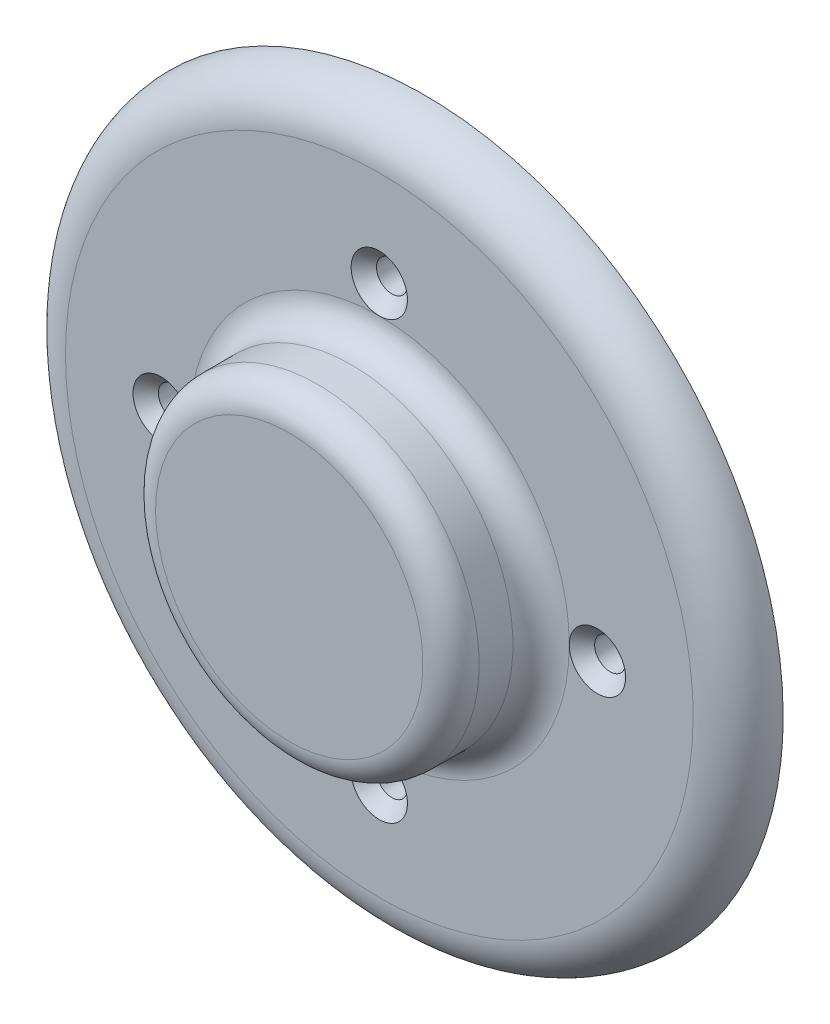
ISO-10303-21;
HEADER;
FILE_DESCRIPTION(('STEP AP214'),'2;1');
FILE_NAME('part.step','',(''),(''),'','','');
FILE_SCHEMA(('AUTOMOTIVE_DESIGN { 1 0 10303 214 1 1 1 1 }'));
ENDSEC;
DATA;
#1=APPLICATION_CONTEXT('core data for automotive mechanical design processes');
#2=APPLICATION_PROTOCOL_DEFINITION('international standard','automotive_design',2000,#1);
#3=PRODUCT_CONTEXT('',#1,'mechanical');
#4=PRODUCT('Part','Part','',(#3));
#5=PRODUCT_RELATED_PRODUCT_CATEGORY('part','',(#4));
#6=PRODUCT_DEFINITION_FORMATION('','',#4);
#7=PRODUCT_DEFINITION_CONTEXT('part definition',#1,'design');
#8=PRODUCT_DEFINITION('design','',#6,#7);
#9=PRODUCT_DEFINITION_SHAPE('','',#8);
#10=(LENGTH_UNIT() NAMED_UNIT(*) SI_UNIT(.MILLI.,.METRE.));
#11=(NAMED_UNIT(*) PLANE_ANGLE_UNIT() SI_UNIT($,.RADIAN.));
#12=(NAMED_UNIT(*) SI_UNIT($,.STERADIAN.) SOLID_ANGLE_UNIT());
#13=UNCERTAINTY_MEASURE_WITH_UNIT(LENGTH_MEASURE(1.E-05),#10,'distance_accuracy_value','');
#14=(GEOMETRIC_REPRESENTATION_CONTEXT(3) GLOBAL_UNCERTAINTY_ASSIGNED_CONTEXT((#13)) GLOBAL_UNIT_ASSIGNED_CONTEXT((#10,
#11,#12)) REPRESENTATION_CONTEXT('',''));
#15=CARTESIAN_POINT('',(0.,0.,0.));
#16=DIRECTION('',(0.,0.,1.));
#17=DIRECTION('',(1.,0.,0.));
#18=AXIS2_PLACEMENT_3D('',#15,#16,#17);
#19=CARTESIAN_POINT('',(111.5,0.,-32.));
#20=CARTESIAN_POINT('',(111.5,7.29765793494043,-32.));
#21=CARTESIAN_POINT('',(110.781261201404,14.5951354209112,-32.));
#22=CARTESIAN_POINT('',(107.933856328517,28.9100063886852,-32.));
#23=CARTESIAN_POINT('',(105.805260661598,35.9270459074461,-32.));
#24=CARTESIAN_POINT('',(100.219875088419,49.4113595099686,-32.));
#25=CARTESIAN_POINT('',(96.763223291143,55.8783001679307,-32.));
#26=CARTESIAN_POINT('',(88.6545002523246,68.0138617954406,-32.));
#27=CARTESIAN_POINT('',(84.0026295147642,73.6821826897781,-32.));
#28=CARTESIAN_POINT('',(73.6821826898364,84.0026295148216,-32.));
#29=CARTESIAN_POINT('',(68.0138617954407,88.6545002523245,-32.));
#30=CARTESIAN_POINT('',(55.8783001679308,96.763223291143,-32.));
#31=CARTESIAN_POINT('',(49.4113595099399,100.219875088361,-32.));
#32=CARTESIAN_POINT('',(35.9270459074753,105.805260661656,-32.));
#33=CARTESIAN_POINT('',(28.9100063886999,107.933856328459,-32.));
#34=CARTESIAN_POINT('',(14.595135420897,110.781261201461,-32.));
#35=CARTESIAN_POINT('',(7.29765793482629,111.5,-32.));
#36=CARTESIAN_POINT('',(-7.29765793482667,111.5,-32.));
#37=CARTESIAN_POINT('',(-14.5951354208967,110.781261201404,-32.));
#38=CARTESIAN_POINT('',(-28.9100063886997,107.933856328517,-32.));
#39=CARTESIAN_POINT('',(-35.9270459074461,105.805260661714,-32.));
#40=CARTESIAN_POINT('',(-49.4113595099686,100.219875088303,-32.));
#41=CARTESIAN_POINT('',(-55.8783001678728,96.763223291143,-32.));
#42=CARTESIAN_POINT('',(-68.0138617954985,88.6545002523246,-32.));
#43=CARTESIAN_POINT('',(-73.6821826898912,84.0026295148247,-32.));
#44=CARTESIAN_POINT('',(-84.0026295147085,73.6821826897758,-32.));
#45=CARTESIAN_POINT('',(-88.6545002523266,68.0138617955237,-32.));
#46=CARTESIAN_POINT('',(-96.7632232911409,55.8783001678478,-32.));
#47=CARTESIAN_POINT('',(-100.219875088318,49.4113595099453,-32.));
#48=CARTESIAN_POINT('',(-105.805260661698,35.92704590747,-32.));
#49=CARTESIAN_POINT('',(-107.933856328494,28.9100063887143,-32.));
#50=CARTESIAN_POINT('',(-110.781261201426,14.5951354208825,-32.));
#51=CARTESIAN_POINT('',(-111.5,7.29765793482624,-32.));
#52=CARTESIAN_POINT('',(-111.5,-7.29765793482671,-32.));
#53=CARTESIAN_POINT('',(-110.781261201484,-14.5951354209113,-32.));
#54=CARTESIAN_POINT('',(-107.933856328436,-28.9100063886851,-32.));
#55=CARTESIAN_POINT('',(-105.805260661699,-35.9270459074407,-32.));
#56=CARTESIAN_POINT('',(-100.219875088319,-49.411359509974,-32.));
#57=CARTESIAN_POINT('',(-96.763223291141,-55.8783001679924,-32.));
#58=CARTESIAN_POINT('',(-88.6545002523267,-68.0138617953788,-32.));
#59=CARTESIAN_POINT('',(-84.0026295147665,-73.6821826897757,-32.));
#60=CARTESIAN_POINT('',(-73.6821826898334,-84.0026295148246,-32.));
#61=CARTESIAN_POINT('',(-68.0138617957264,-88.6545002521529,-32.));
#62=CARTESIAN_POINT('',(-55.8783001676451,-96.7632232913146,-32.));
#63=CARTESIAN_POINT('',(-49.4113595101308,-100.219875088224,-32.));
#64=CARTESIAN_POINT('',(-35.9270459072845,-105.805260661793,-32.));
#65=CARTESIAN_POINT('',(-28.9100063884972,-107.933856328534,-32.));
#66=CARTESIAN_POINT('',(-14.5951354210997,-110.781261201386,-32.));
#67=CARTESIAN_POINT('',(-7.297657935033,-111.5,-32.));
#68=CARTESIAN_POINT('',(7.29765793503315,-111.5,-32.));
#69=CARTESIAN_POINT('',(14.5951354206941,-110.781261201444,-32.));
#70=CARTESIAN_POINT('',(28.9100063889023,-107.933856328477,-32.));
#71=CARTESIAN_POINT('',(35.9270459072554,-105.805260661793,-32.));
#72=CARTESIAN_POINT('',(49.4113595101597,-100.219875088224,-32.));
#73=CARTESIAN_POINT('',(55.8783001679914,-96.7632232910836,-32.));
#74=CARTESIAN_POINT('',(68.0138617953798,-88.654500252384,-32.));
#75=CARTESIAN_POINT('',(73.6821826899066,-84.0026295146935,-32.));
#76=CARTESIAN_POINT('',(84.0026295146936,-73.6821826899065,-32.));
#77=CARTESIAN_POINT('',(88.6545002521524,-68.0138617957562,-32.));
#78=CARTESIAN_POINT('',(96.7632232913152,-55.8783001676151,-32.));
#79=CARTESIAN_POINT('',(100.219875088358,-49.4113595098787,-32.));
#80=CARTESIAN_POINT('',(105.805260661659,-35.9270459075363,-32.));
#81=CARTESIAN_POINT('',(107.933856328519,-28.9100063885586,-32.));
#82=CARTESIAN_POINT('',(110.781261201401,-14.5951354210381,-32.));
#83=CARTESIAN_POINT('',(111.5,-7.29765793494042,-32.));
#84=CARTESIAN_POINT('',(111.5,0.,-32.));
#85=CARTESIAN_POINT('',(127.5,0.,-32.));
#86=CARTESIAN_POINT('',(127.5,8.34485548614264,-32.));
#87=CARTESIAN_POINT('',(126.678123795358,16.6895046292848,-32.));
#88=CARTESIAN_POINT('',(123.422122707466,33.0585274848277,-32.));
#89=CARTESIAN_POINT('',(120.988078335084,41.0824964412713,-32.));
#90=CARTESIAN_POINT('',(114.601202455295,56.5017788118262,-32.));
#91=CARTESIAN_POINT('',(110.648528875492,63.8967109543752,-32.));
#92=CARTESIAN_POINT('',(101.376222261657,77.7736984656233,-32.));
#93=CARTESIAN_POINT('',(96.0568185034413,84.2554106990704,-32.));
#94=CARTESIAN_POINT('',(84.2554106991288,96.0568185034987,-32.));
#95=CARTESIAN_POINT('',(77.7736984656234,101.376222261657,-32.));
#96=CARTESIAN_POINT('',(63.8967109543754,110.648528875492,-32.));
#97=CARTESIAN_POINT('',(56.5017788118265,114.601202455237,-32.));
#98=CARTESIAN_POINT('',(41.0824964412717,120.988078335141,-32.));
#99=CARTESIAN_POINT('',(33.058527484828,123.422122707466,-32.));
#100=CARTESIAN_POINT('',(16.689504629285,126.678123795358,-32.));
#101=CARTESIAN_POINT('',(8.34485548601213,127.5,-32.));
#102=CARTESIAN_POINT('',(-8.34485548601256,127.5,-32.));
#103=CARTESIAN_POINT('',(-16.6895046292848,126.678123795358,-32.));
#104=CARTESIAN_POINT('',(-33.0585274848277,123.422122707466,-32.));
#105=CARTESIAN_POINT('',(-41.0824964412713,120.988078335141,-32.));
#106=CARTESIAN_POINT('',(-56.5017788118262,114.601202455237,-32.));
#107=CARTESIAN_POINT('',(-63.8967109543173,110.648528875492,-32.));
#108=CARTESIAN_POINT('',(-77.7736984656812,101.376222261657,-32.));
#109=CARTESIAN_POINT('',(-84.2554106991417,96.0568185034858,-32.));
#110=CARTESIAN_POINT('',(-96.0568185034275,84.2554106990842,-32.));
#111=CARTESIAN_POINT('',(-101.376222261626,77.7736984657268,-32.));
#112=CARTESIAN_POINT('',(-110.648528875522,63.896710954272,-32.));
#113=CARTESIAN_POINT('',(-114.601202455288,56.5017788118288,-32.));
#114=CARTESIAN_POINT('',(-120.98807833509,41.0824964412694,-32.));
#115=CARTESIAN_POINT('',(-123.422122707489,33.0585274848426,-32.));
#116=CARTESIAN_POINT('',(-126.678123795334,16.6895046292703,-32.));
#117=CARTESIAN_POINT('',(-127.5,8.34485548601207,-32.));
#118=CARTESIAN_POINT('',(-127.5,-8.34485548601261,-32.));
#119=CARTESIAN_POINT('',(-126.678123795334,-16.6895046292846,-32.));
#120=CARTESIAN_POINT('',(-123.422122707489,-33.0585274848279,-32.));
#121=CARTESIAN_POINT('',(-120.988078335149,-41.0824964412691,-32.));
#122=CARTESIAN_POINT('',(-114.60120245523,-56.5017788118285,-32.));
#123=CARTESIAN_POINT('',(-110.648528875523,-63.8967109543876,-32.));
#124=CARTESIAN_POINT('',(-101.376222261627,-77.7736984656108,-32.));
#125=CARTESIAN_POINT('',(-96.0568185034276,-84.2554106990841,-32.));
#126=CARTESIAN_POINT('',(-84.2554106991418,-96.0568185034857,-32.));
#127=CARTESIAN_POINT('',(-77.7736984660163,-101.376222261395,-32.));
#128=CARTESIAN_POINT('',(-63.8967109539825,-110.648528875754,-32.));
#129=CARTESIAN_POINT('',(-56.5017788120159,-114.601202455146,-32.));
#130=CARTESIAN_POINT('',(-41.0824964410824,-120.988078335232,-32.));
#131=CARTESIAN_POINT('',(-33.0585274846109,-123.422122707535,-32.));
#132=CARTESIAN_POINT('',(-16.6895046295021,-126.678123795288,-32.));
#133=CARTESIAN_POINT('',(-8.34485548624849,-127.5,-32.));
#134=CARTESIAN_POINT('',(8.34485548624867,-127.5,-32.));
#135=CARTESIAN_POINT('',(16.6895046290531,-126.678123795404,-32.));
#136=CARTESIAN_POINT('',(33.0585274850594,-123.42212270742,-32.));
#137=CARTESIAN_POINT('',(41.0824964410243,-120.988078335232,-32.));
#138=CARTESIAN_POINT('',(56.5017788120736,-114.601202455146,-32.));
#139=CARTESIAN_POINT('',(63.896710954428,-110.648528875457,-32.));
#140=CARTESIAN_POINT('',(77.7736984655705,-101.376222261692,-32.));
#141=CARTESIAN_POINT('',(84.2554106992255,-96.0568185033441,-32.));
#142=CARTESIAN_POINT('',(96.0568185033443,-84.2554106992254,-32.));
#143=CARTESIAN_POINT('',(101.37622226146,-77.7736984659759,-32.));
#144=CARTESIAN_POINT('',(110.648528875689,-63.8967109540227,-32.));
#145=CARTESIAN_POINT('',(114.601202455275,-56.5017788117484,-32.));
#146=CARTESIAN_POINT('',(120.988078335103,-41.0824964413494,-32.));
#147=CARTESIAN_POINT('',(123.422122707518,-33.0585274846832,-32.));
#148=CARTESIAN_POINT('',(126.678123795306,-16.6895046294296,-32.));
#149=CARTESIAN_POINT('',(127.5,-8.34485548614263,-32.));
#150=CARTESIAN_POINT('',(127.5,0.,-32.));
#151=CARTESIAN_POINT('',(127.5,0.,-48.));
#152=CARTESIAN_POINT('',(127.5,8.34485548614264,-48.));
#153=CARTESIAN_POINT('',(126.678123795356,16.6895046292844,-48.));
#154=CARTESIAN_POINT('',(123.422122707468,33.0585274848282,-48.));
#155=CARTESIAN_POINT('',(120.98807833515,41.0824964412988,-48.));
#156=CARTESIAN_POINT('',(114.601202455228,56.5017788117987,-48.));
#157=CARTESIAN_POINT('',(110.648528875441,63.8967109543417,-48.));
#158=CARTESIAN_POINT('',(101.376222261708,77.7736984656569,-48.));
#159=CARTESIAN_POINT('',(96.0568185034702,84.2554106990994,-48.));
#160=CARTESIAN_POINT('',(84.2554106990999,96.0568185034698,-48.));
#161=CARTESIAN_POINT('',(77.773698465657,101.376222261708,-48.));
#162=CARTESIAN_POINT('',(63.8967109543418,110.648528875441,-48.));
#163=CARTESIAN_POINT('',(56.5017788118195,114.60120245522,-48.));
#164=CARTESIAN_POINT('',(41.0824964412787,120.988078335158,-48.));
#165=CARTESIAN_POINT('',(33.0585274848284,123.422122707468,-48.));
#166=CARTESIAN_POINT('',(16.6895046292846,126.678123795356,-48.));
#167=CARTESIAN_POINT('',(8.34485548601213,127.5,-48.));
#168=CARTESIAN_POINT('',(-8.34485548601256,127.5,-48.));
#169=CARTESIAN_POINT('',(-16.6895046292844,126.678123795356,-48.));
#170=CARTESIAN_POINT('',(-33.0585274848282,123.422122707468,-48.));
#171=CARTESIAN_POINT('',(-41.0824964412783,120.988078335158,-48.));
#172=CARTESIAN_POINT('',(-56.5017788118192,114.60120245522,-48.));
#173=CARTESIAN_POINT('',(-63.8967109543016,110.648528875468,-48.));
#174=CARTESIAN_POINT('',(-77.7736984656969,101.376222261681,-48.));
#175=CARTESIAN_POINT('',(-84.2554106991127,96.0568185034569,-48.));
#176=CARTESIAN_POINT('',(-96.0568185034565,84.2554106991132,-48.));
#177=CARTESIAN_POINT('',(-101.37622226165,77.7736984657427,-48.));
#178=CARTESIAN_POINT('',(-110.648528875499,63.896710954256,-48.));
#179=CARTESIAN_POINT('',(-114.601202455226,56.5017788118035,-48.));
#180=CARTESIAN_POINT('',(-120.988078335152,41.0824964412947,-48.));
#181=CARTESIAN_POINT('',(-123.422122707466,33.0585274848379,-48.));
#182=CARTESIAN_POINT('',(-126.678123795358,16.689504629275,-48.));
#183=CARTESIAN_POINT('',(-127.5,8.34485548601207,-48.));
#184=CARTESIAN_POINT('',(-127.5,-8.34485548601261,-48.));
#185=CARTESIAN_POINT('',(-126.678123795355,-16.6895046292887,-48.));
#186=CARTESIAN_POINT('',(-123.422122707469,-33.0585274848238,-48.));
#187=CARTESIAN_POINT('',(-120.98807833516,-41.0824964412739,-48.));
#188=CARTESIAN_POINT('',(-114.601202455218,-56.5017788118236,-48.));
#189=CARTESIAN_POINT('',(-110.648528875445,-63.8967109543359,-48.));
#190=CARTESIAN_POINT('',(-101.376222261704,-77.7736984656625,-48.));
#191=CARTESIAN_POINT('',(-96.0568185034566,-84.255410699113,-48.));
#192=CARTESIAN_POINT('',(-84.2554106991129,-96.0568185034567,-48.));
#193=CARTESIAN_POINT('',(-77.7736984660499,-101.376222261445,-48.));
#194=CARTESIAN_POINT('',(-63.8967109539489,-110.648528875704,-48.));
#195=CARTESIAN_POINT('',(-56.5017788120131,-114.60120245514,-48.));
#196=CARTESIAN_POINT('',(-41.0824964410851,-120.988078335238,-48.));
#197=CARTESIAN_POINT('',(-33.0585274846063,-123.422122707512,-48.));
#198=CARTESIAN_POINT('',(-16.6895046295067,-126.678123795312,-48.));
#199=CARTESIAN_POINT('',(-8.34485548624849,-127.5,-48.));
#200=CARTESIAN_POINT('',(8.34485548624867,-127.5,-48.));
#201=CARTESIAN_POINT('',(16.6895046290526,-126.678123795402,-48.));
#202=CARTESIAN_POINT('',(33.0585274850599,-123.422122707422,-48.));
#203=CARTESIAN_POINT('',(41.0824964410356,-120.988078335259,-48.));
#204=CARTESIAN_POINT('',(56.5017788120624,-114.601202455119,-48.));
#205=CARTESIAN_POINT('',(63.8967109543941,-110.648528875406,-48.));
#206=CARTESIAN_POINT('',(77.7736984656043,-101.376222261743,-48.));
#207=CARTESIAN_POINT('',(84.2554106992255,-96.0568185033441,-48.));
#208=CARTESIAN_POINT('',(96.0568185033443,-84.2554106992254,-48.));
#209=CARTESIAN_POINT('',(101.376222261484,-77.7736984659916,-48.));
#210=CARTESIAN_POINT('',(110.648528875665,-63.896710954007,-48.));
#211=CARTESIAN_POINT('',(114.601202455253,-56.5017788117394,-48.));
#212=CARTESIAN_POINT('',(120.988078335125,-41.0824964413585,-48.));
#213=CARTESIAN_POINT('',(123.422122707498,-33.0585274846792,-48.));
#214=CARTESIAN_POINT('',(126.678123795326,-16.6895046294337,-48.));
#215=CARTESIAN_POINT('',(127.5,-8.34485548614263,-48.));
#216=CARTESIAN_POINT('',(127.5,0.,-48.));
#217=(BOUNDED_SURFACE() B_SPLINE_SURFACE(2,3,((#19,#20,#21,#22,#23,#24,#25,#26,#27,#28,#29,#30,
#31,#32,#33,#34,#35,#36,#37,#38,#39,#40,#41,#42,#43,#44,#45,#46,#47,#48,#49,#50,#51,#52,#53,#54,
#55,#56,#57,#58,#59,#60,#61,#62,#63,#64,#65,#66,#67,#68,#69,#70,#71,#72,#73,#74,#75,#76,#77,#78,
#79,#80,#81,#82,#83,#84),(#85,#86,#87,#88,#89,#90,#91,#92,#93,#94,#95,#96,#97,#98,#99,#100,#101,
#102,#103,#104,#105,#106,#107,#108,#109,#110,#111,#112,#113,#114,#115,#116,#117,#118,#119,#120,
#121,#122,#123,#124,#125,#126,#127,#128,#129,#130,#131,#132,#133,#134,#135,#136,#137,#138,#139,
#140,#141,#142,#143,#144,#145,#146,#147,#148,#149,#150),(#151,#152,#153,#154,#155,#156,#157,
#158,#159,#160,#161,#162,#163,#164,#165,#166,#167,#168,#169,#170,#171,#172,#173,#174,#175,#176,
#177,#178,#179,#180,#181,#182,#183,#184,#185,#186,#187,#188,#189,#190,#191,#192,#193,#194,#195,
#196,#197,#198,#199,#200,#201,#202,#203,#204,#205,#206,#207,#208,#209,#210,#211,#212,#213,#214,
#215,#216)),.UNSPECIFIED.,.F.,.T.,.F.) B_SPLINE_SURFACE_WITH_KNOTS((3,3),(4,2,2,2,2,2,2,2,2,2,2,
2,2,2,2,2,2,2,2,2,2,2,2,2,2,2,2,2,2,2,2,2,4),(0.,1.),(-6.28318530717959,-6.08683576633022,
-5.89048622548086,-5.6941366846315,-5.49778714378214,-5.30143760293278,-5.10508806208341,
-4.90873852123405,-4.71238898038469,-4.51603943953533,-4.31968989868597,-4.1233403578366,
-3.92699081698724,-3.73064127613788,-3.53429173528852,-3.33794219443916,-3.14159265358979,
-2.94524311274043,-2.74889357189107,-2.55254403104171,-2.35619449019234,-2.15984494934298,
-1.96349540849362,-1.76714586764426,-1.5707963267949,-1.37444678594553,-1.17809724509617,
-0.98174770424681,-0.785398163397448,-0.589048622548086,-0.392699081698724,-0.196349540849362,
0.),.UNSPECIFIED.) GEOMETRIC_REPRESENTATION_ITEM() RATIONAL_B_SPLINE_SURFACE(((1.,1.,1.,1.,1.,
1.,1.,1.,1.,1.,1.,1.,1.,1.,1.,1.,1.,1.,1.,1.,1.,1.,1.,1.,1.,1.,1.,1.,1.,1.,1.,1.,1.,1.,1.,1.,1.,
1.,1.,1.,1.,1.,1.,1.,1.,1.,1.,1.,1.,1.,1.,1.,1.,1.,1.,1.,1.,1.,1.,1.,1.,1.,1.,1.,1.,1.),
(0.707106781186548,0.707106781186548,0.707106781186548,0.707106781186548,0.707106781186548,
0.707106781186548,0.707106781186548,0.707106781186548,0.707106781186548,0.707106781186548,
0.707106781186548,0.707106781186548,0.707106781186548,0.707106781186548,0.707106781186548,
0.707106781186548,0.707106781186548,0.707106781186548,0.707106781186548,0.707106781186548,
0.707106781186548,0.707106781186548,0.707106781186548,0.707106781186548,0.707106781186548,
0.707106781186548,0.707106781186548,0.707106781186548,0.707106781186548,0.707106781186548,
0.707106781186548,0.707106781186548,0.707106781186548,0.707106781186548,0.707106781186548,
0.707106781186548,0.707106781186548,0.707106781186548,0.707106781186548,0.707106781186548,
0.707106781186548,0.707106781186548,0.707106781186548,0.707106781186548,0.707106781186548,
0.707106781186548,0.707106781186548,0.707106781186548,0.707106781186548,0.707106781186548,
0.707106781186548,0.707106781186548,0.707106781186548,0.707106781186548,0.707106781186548,
0.707106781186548,0.707106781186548,0.707106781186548,0.707106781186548,0.707106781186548,
0.707106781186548,0.707106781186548,0.707106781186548,0.707106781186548,0.707106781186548,
0.707106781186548),(1.,1.,1.,1.,1.,1.,1.,1.,1.,1.,1.,1.,1.,1.,1.,1.,1.,1.,1.,1.,1.,1.,1.,1.,1.,
1.,1.,1.,1.,1.,1.,1.,1.,1.,1.,1.,1.,1.,1.,1.,1.,1.,1.,1.,1.,1.,1.,1.,1.,1.,1.,1.,1.,1.,1.,1.,1.,
1.,1.,1.,1.,1.,1.,1.,1.,1.))) REPRESENTATION_ITEM('') SURFACE());
#218=CARTESIAN_POINT('',(111.5,0.,-32.));
#219=CARTESIAN_POINT('',(111.5,-7.29765793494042,-32.));
#220=CARTESIAN_POINT('',(110.781261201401,-14.5951354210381,-32.));
#221=CARTESIAN_POINT('',(107.933856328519,-28.9100063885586,-32.));
#222=CARTESIAN_POINT('',(105.805260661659,-35.9270459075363,-32.));
#223=CARTESIAN_POINT('',(100.219875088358,-49.4113595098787,-32.));
#224=CARTESIAN_POINT('',(96.7632232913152,-55.8783001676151,-32.));
#225=CARTESIAN_POINT('',(88.6545002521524,-68.0138617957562,-32.));
#226=CARTESIAN_POINT('',(84.0026295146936,-73.6821826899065,-32.));
#227=CARTESIAN_POINT('',(73.6821826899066,-84.0026295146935,-32.));
#228=CARTESIAN_POINT('',(68.0138617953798,-88.654500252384,-32.));
#229=CARTESIAN_POINT('',(55.8783001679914,-96.7632232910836,-32.));
#230=CARTESIAN_POINT('',(49.4113595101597,-100.219875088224,-32.));
#231=CARTESIAN_POINT('',(35.9270459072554,-105.805260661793,-32.));
#232=CARTESIAN_POINT('',(28.9100063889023,-107.933856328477,-32.));
#233=CARTESIAN_POINT('',(14.5951354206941,-110.781261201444,-32.));
#234=CARTESIAN_POINT('',(7.29765793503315,-111.5,-32.));
#235=CARTESIAN_POINT('',(-7.297657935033,-111.5,-32.));
#236=CARTESIAN_POINT('',(-14.5951354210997,-110.781261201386,-32.));
#237=CARTESIAN_POINT('',(-28.9100063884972,-107.933856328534,-32.));
#238=CARTESIAN_POINT('',(-35.9270459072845,-105.805260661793,-32.));
#239=CARTESIAN_POINT('',(-49.4113595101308,-100.219875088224,-32.));
#240=CARTESIAN_POINT('',(-55.8783001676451,-96.7632232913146,-32.));
#241=CARTESIAN_POINT('',(-68.0138617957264,-88.6545002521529,-32.));
#242=CARTESIAN_POINT('',(-73.6821826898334,-84.0026295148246,-32.));
#243=CARTESIAN_POINT('',(-84.0026295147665,-73.6821826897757,-32.));
#244=CARTESIAN_POINT('',(-88.6545002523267,-68.0138617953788,-32.));
#245=CARTESIAN_POINT('',(-96.763223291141,-55.8783001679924,-32.));
#246=CARTESIAN_POINT('',(-100.219875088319,-49.411359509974,-32.));
#247=CARTESIAN_POINT('',(-105.805260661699,-35.9270459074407,-32.));
#248=CARTESIAN_POINT('',(-107.933856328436,-28.9100063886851,-32.));
#249=CARTESIAN_POINT('',(-110.781261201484,-14.5951354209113,-32.));
#250=CARTESIAN_POINT('',(-111.5,-7.29765793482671,-32.));
#251=CARTESIAN_POINT('',(-111.5,7.29765793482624,-32.));
#252=CARTESIAN_POINT('',(-110.781261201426,14.5951354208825,-32.));
#253=CARTESIAN_POINT('',(-107.933856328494,28.9100063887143,-32.));
#254=CARTESIAN_POINT('',(-105.805260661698,35.92704590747,-32.));
#255=CARTESIAN_POINT('',(-100.219875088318,49.4113595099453,-32.));
#256=CARTESIAN_POINT('',(-96.7632232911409,55.8783001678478,-32.));
#257=CARTESIAN_POINT('',(-88.6545002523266,68.0138617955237,-32.));
#258=CARTESIAN_POINT('',(-84.0026295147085,73.6821826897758,-32.));
#259=CARTESIAN_POINT('',(-73.6821826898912,84.0026295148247,-32.));
#260=CARTESIAN_POINT('',(-68.0138617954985,88.6545002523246,-32.));
#261=CARTESIAN_POINT('',(-55.8783001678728,96.763223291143,-32.));
#262=CARTESIAN_POINT('',(-49.4113595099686,100.219875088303,-32.));
#263=CARTESIAN_POINT('',(-35.9270459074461,105.805260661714,-32.));
#264=CARTESIAN_POINT('',(-28.9100063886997,107.933856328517,-32.));
#265=CARTESIAN_POINT('',(-14.5951354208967,110.781261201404,-32.));
#266=CARTESIAN_POINT('',(-7.29765793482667,111.5,-32.));
#267=CARTESIAN_POINT('',(7.29765793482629,111.5,-32.));
#268=CARTESIAN_POINT('',(14.595135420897,110.781261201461,-32.));
#269=CARTESIAN_POINT('',(28.9100063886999,107.933856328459,-32.));
#270=CARTESIAN_POINT('',(35.9270459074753,105.805260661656,-32.));
#271=CARTESIAN_POINT('',(49.4113595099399,100.219875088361,-32.));
#272=CARTESIAN_POINT('',(55.8783001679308,96.763223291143,-32.));
#273=CARTESIAN_POINT('',(68.0138617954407,88.6545002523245,-32.));
#274=CARTESIAN_POINT('',(73.6821826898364,84.0026295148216,-32.));
#275=CARTESIAN_POINT('',(84.0026295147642,73.6821826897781,-32.));
#276=CARTESIAN_POINT('',(88.6545002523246,68.0138617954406,-32.));
#277=CARTESIAN_POINT('',(96.763223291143,55.8783001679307,-32.));
#278=CARTESIAN_POINT('',(100.219875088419,49.4113595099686,-32.));
#279=CARTESIAN_POINT('',(105.805260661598,35.9270459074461,-32.));
#280=CARTESIAN_POINT('',(107.933856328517,28.9100063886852,-32.));
#281=CARTESIAN_POINT('',(110.781261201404,14.5951354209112,-32.));
#282=CARTESIAN_POINT('',(111.5,7.29765793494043,-32.));
#283=CARTESIAN_POINT('',(111.5,0.,-32.));
#284=(BOUNDED_CURVE() B_SPLINE_CURVE(3,(#218,#219,#220,#221,#222,#223,#224,#225,#226,#227,#228,
#229,#230,#231,#232,#233,#234,#235,#236,#237,#238,#239,#240,#241,#242,#243,#244,#245,#246,#247,
#248,#249,#250,#251,#252,#253,#254,#255,#256,#257,#258,#259,#260,#261,#262,#263,#264,#265,#266,
#267,#268,#269,#270,#271,#272,#273,#274,#275,#276,#277,#278,#279,#280,#281,#282,#283),
.UNSPECIFIED.,.T.,.F.) B_SPLINE_CURVE_WITH_KNOTS((4,2,2,2,2,2,2,2,2,2,2,2,2,2,2,2,2,2,2,2,2,2,2,
2,2,2,2,2,2,2,2,2,4),(-6.28318530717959,-6.08683576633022,-5.89048622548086,-5.6941366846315,
-5.49778714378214,-5.30143760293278,-5.10508806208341,-4.90873852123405,-4.71238898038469,
-4.51603943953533,-4.31968989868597,-4.1233403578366,-3.92699081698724,-3.73064127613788,
-3.53429173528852,-3.33794219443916,-3.14159265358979,-2.94524311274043,-2.74889357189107,
-2.55254403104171,-2.35619449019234,-2.15984494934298,-1.96349540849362,-1.76714586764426,
-1.5707963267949,-1.37444678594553,-1.17809724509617,-0.981747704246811,-0.785398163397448,
-0.589048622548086,-0.392699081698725,-0.196349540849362,0.),
.UNSPECIFIED.) CURVE() GEOMETRIC_REPRESENTATION_ITEM() RATIONAL_B_SPLINE_CURVE((1.,1.,1.,1.,1.,
1.,1.,1.,1.,1.,1.,1.,1.,1.,1.,1.,1.,1.,1.,1.,1.,1.,1.,1.,1.,1.,1.,1.,1.,1.,1.,1.,1.,1.,1.,1.,1.,
1.,1.,1.,1.,1.,1.,1.,1.,1.,1.,1.,1.,1.,1.,1.,1.,1.,1.,1.,1.,1.,1.,1.,1.,1.,1.,1.,1.,1.)) REPRESENTATION_ITEM(''));
#285=CARTESIAN_POINT('',(111.5,0.,-32.));
#286=VERTEX_POINT('',#285);
#287=EDGE_CURVE('E11',#286,#286,#284,.F.);
#288=CARTESIAN_POINT('',(127.5,0.,-48.));
#289=CARTESIAN_POINT('',(127.5,8.34485548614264,-48.));
#290=CARTESIAN_POINT('',(126.678123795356,16.6895046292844,-48.));
#291=CARTESIAN_POINT('',(123.422122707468,33.0585274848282,-48.));
#292=CARTESIAN_POINT('',(120.98807833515,41.0824964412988,-48.));
#293=CARTESIAN_POINT('',(114.601202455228,56.5017788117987,-48.));
#294=CARTESIAN_POINT('',(110.648528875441,63.8967109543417,-48.));
#295=CARTESIAN_POINT('',(101.376222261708,77.7736984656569,-48.));
#296=CARTESIAN_POINT('',(96.0568185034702,84.2554106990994,-48.));
#297=CARTESIAN_POINT('',(84.2554106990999,96.0568185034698,-48.));
#298=CARTESIAN_POINT('',(77.773698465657,101.376222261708,-48.));
#299=CARTESIAN_POINT('',(63.8967109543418,110.648528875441,-48.));
#300=CARTESIAN_POINT('',(56.5017788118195,114.60120245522,-48.));
#301=CARTESIAN_POINT('',(41.0824964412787,120.988078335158,-48.));
#302=CARTESIAN_POINT('',(33.0585274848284,123.422122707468,-48.));
#303=CARTESIAN_POINT('',(16.6895046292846,126.678123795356,-48.));
#304=CARTESIAN_POINT('',(8.34485548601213,127.5,-48.));
#305=CARTESIAN_POINT('',(-8.34485548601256,127.5,-48.));
#306=CARTESIAN_POINT('',(-16.6895046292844,126.678123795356,-48.));
#307=CARTESIAN_POINT('',(-33.0585274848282,123.422122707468,-48.));
#308=CARTESIAN_POINT('',(-41.0824964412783,120.988078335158,-48.));
#309=CARTESIAN_POINT('',(-56.5017788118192,114.60120245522,-48.));
#310=CARTESIAN_POINT('',(-63.8967109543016,110.648528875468,-48.));
#311=CARTESIAN_POINT('',(-77.7736984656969,101.376222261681,-48.));
#312=CARTESIAN_POINT('',(-84.2554106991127,96.0568185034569,-48.));
#313=CARTESIAN_POINT('',(-96.0568185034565,84.2554106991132,-48.));
#314=CARTESIAN_POINT('',(-101.37622226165,77.7736984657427,-48.));
#315=CARTESIAN_POINT('',(-110.648528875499,63.896710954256,-48.));
#316=CARTESIAN_POINT('',(-114.601202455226,56.5017788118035,-48.));
#317=CARTESIAN_POINT('',(-120.988078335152,41.0824964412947,-48.));
#318=CARTESIAN_POINT('',(-123.422122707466,33.0585274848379,-48.));
#319=CARTESIAN_POINT('',(-126.678123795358,16.689504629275,-48.));
#320=CARTESIAN_POINT('',(-127.5,8.34485548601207,-48.));
#321=CARTESIAN_POINT('',(-127.5,-8.34485548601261,-48.));
#322=CARTESIAN_POINT('',(-126.678123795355,-16.6895046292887,-48.));
#323=CARTESIAN_POINT('',(-123.422122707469,-33.0585274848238,-48.));
#324=CARTESIAN_POINT('',(-120.98807833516,-41.0824964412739,-48.));
#325=CARTESIAN_POINT('',(-114.601202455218,-56.5017788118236,-48.));
#326=CARTESIAN_POINT('',(-110.648528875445,-63.8967109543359,-48.));
#327=CARTESIAN_POINT('',(-101.376222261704,-77.7736984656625,-48.));
#328=CARTESIAN_POINT('',(-96.0568185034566,-84.255410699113,-48.));
#329=CARTESIAN_POINT('',(-84.2554106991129,-96.0568185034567,-48.));
#330=CARTESIAN_POINT('',(-77.7736984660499,-101.376222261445,-48.));
#331=CARTESIAN_POINT('',(-63.8967109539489,-110.648528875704,-48.));
#332=CARTESIAN_POINT('',(-56.5017788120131,-114.60120245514,-48.));
#333=CARTESIAN_POINT('',(-41.0824964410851,-120.988078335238,-48.));
#334=CARTESIAN_POINT('',(-33.0585274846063,-123.422122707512,-48.));
#335=CARTESIAN_POINT('',(-16.6895046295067,-126.678123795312,-48.));
#336=CARTESIAN_POINT('',(-8.34485548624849,-127.5,-48.));
#337=CARTESIAN_POINT('',(8.34485548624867,-127.5,-48.));
#338=CARTESIAN_POINT('',(16.6895046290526,-126.678123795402,-48.));
#339=CARTESIAN_POINT('',(33.0585274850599,-123.422122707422,-48.));
#340=CARTESIAN_POINT('',(41.0824964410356,-120.988078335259,-48.));
#341=CARTESIAN_POINT('',(56.5017788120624,-114.601202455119,-48.));
#342=CARTESIAN_POINT('',(63.8967109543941,-110.648528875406,-48.));
#343=CARTESIAN_POINT('',(77.7736984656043,-101.376222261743,-48.));
#344=CARTESIAN_POINT('',(84.2554106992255,-96.0568185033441,-48.));
#345=CARTESIAN_POINT('',(96.0568185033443,-84.2554106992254,-48.));
#346=CARTESIAN_POINT('',(101.376222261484,-77.7736984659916,-48.));
#347=CARTESIAN_POINT('',(110.648528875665,-63.896710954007,-48.));
#348=CARTESIAN_POINT('',(114.601202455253,-56.5017788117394,-48.));
#349=CARTESIAN_POINT('',(120.988078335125,-41.0824964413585,-48.));
#350=CARTESIAN_POINT('',(123.422122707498,-33.0585274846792,-48.));
#351=CARTESIAN_POINT('',(126.678123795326,-16.6895046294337,-48.));
#352=CARTESIAN_POINT('',(127.5,-8.34485548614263,-48.));
#353=CARTESIAN_POINT('',(127.5,0.,-48.));
#354=(BOUNDED_CURVE() B_SPLINE_CURVE(3,(#288,#289,#290,#291,#292,#293,#294,#295,#296,#297,#298,
#299,#300,#301,#302,#303,#304,#305,#306,#307,#308,#309,#310,#311,#312,#313,#314,#315,#316,#317,
#318,#319,#320,#321,#322,#323,#324,#325,#326,#327,#328,#329,#330,#331,#332,#333,#334,#335,#336,
#337,#338,#339,#340,#341,#342,#343,#344,#345,#346,#347,#348,#349,#350,#351,#352,#353),
.UNSPECIFIED.,.T.,.F.) B_SPLINE_CURVE_WITH_KNOTS((4,2,2,2,2,2,2,2,2,2,2,2,2,2,2,2,2,2,2,2,2,2,2,
2,2,2,2,2,2,2,2,2,4),(-6.28318530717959,-6.08683576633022,-5.89048622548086,-5.6941366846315,
-5.49778714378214,-5.30143760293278,-5.10508806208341,-4.90873852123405,-4.71238898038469,
-4.51603943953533,-4.31968989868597,-4.1233403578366,-3.92699081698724,-3.73064127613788,
-3.53429173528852,-3.33794219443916,-3.14159265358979,-2.94524311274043,-2.74889357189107,
-2.55254403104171,-2.35619449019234,-2.15984494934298,-1.96349540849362,-1.76714586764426,
-1.5707963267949,-1.37444678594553,-1.17809724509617,-0.98174770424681,-0.785398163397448,
-0.589048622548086,-0.392699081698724,-0.196349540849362,0.),
.UNSPECIFIED.) CURVE() GEOMETRIC_REPRESENTATION_ITEM() RATIONAL_B_SPLINE_CURVE((1.,1.,1.,1.,1.,
1.,1.,1.,1.,1.,1.,1.,1.,1.,1.,1.,1.,1.,1.,1.,1.,1.,1.,1.,1.,1.,1.,1.,1.,1.,1.,1.,1.,1.,1.,1.,1.,
1.,1.,1.,1.,1.,1.,1.,1.,1.,1.,1.,1.,1.,1.,1.,1.,1.,1.,1.,1.,1.,1.,1.,1.,1.,1.,1.,1.,1.)) REPRESENTATION_ITEM(''));
#355=CARTESIAN_POINT('',(127.5,0.,-48.));
#356=VERTEX_POINT('',#355);
#357=EDGE_CURVE('E111',#356,#356,#354,.T.);
#358=ORIENTED_EDGE('',*,*,#287,.F.);
#359=EDGE_LOOP('',(#358));
#360=FACE_BOUND('',#359,.T.);
#361=ORIENTED_EDGE('',*,*,#357,.T.);
#362=EDGE_LOOP('',(#361));
#363=FACE_BOUND('',#362,.T.);
#364=ADVANCED_FACE('F32',(#360,#363),#217,.T.);
#365=CARTESIAN_POINT('',(0.,0.,0.));
#366=DIRECTION('',(0.,0.,-1.));
#367=DIRECTION('',(-1.,0.,0.));
#368=AXIS2_PLACEMENT_3D('',#365,#366,#367);
#369=PLANE('',#368);
#370=CARTESIAN_POINT('',(0.,0.,0.));
#371=DIRECTION('',(0.,0.,-1.));
#372=DIRECTION('',(-1.,0.,0.));
#373=AXIS2_PLACEMENT_3D('',#370,#371,#372);
#374=CIRCLE('',#373,47.5);
#375=CARTESIAN_POINT('',(-47.5,0.,0.));
#376=VERTEX_POINT('',#375);
#377=EDGE_CURVE('E45',#376,#376,#374,.F.);
#378=ORIENTED_EDGE('',*,*,#377,.T.);
#379=EDGE_LOOP('',(#378));
#380=FACE_BOUND('',#379,.T.);
#381=ADVANCED_FACE('F158',(#380),#369,.F.);
#382=CARTESIAN_POINT('',(0.,0.,0.));
#383=DIRECTION('',(0.,0.,1.));
#384=DIRECTION('',(1.,0.,0.));
#385=AXIS2_PLACEMENT_3D('',#382,#383,#384);
#386=CYLINDRICAL_SURFACE('',#385,57.5);
#387=CARTESIAN_POINT('',(0.,0.,-22.));
#388=DIRECTION('',(0.,0.,-1.));
#389=DIRECTION('',(-1.,0.,0.));
#390=AXIS2_PLACEMENT_3D('',#387,#388,#389);
#391=CIRCLE('',#390,57.5);
#392=CARTESIAN_POINT('',(-57.5,0.,-22.));
#393=VERTEX_POINT('',#392);
#394=EDGE_CURVE('E127',#393,#393,#391,.F.);
#395=ORIENTED_EDGE('',*,*,#394,.T.);
#396=EDGE_LOOP('',(#395));
#397=FACE_BOUND('',#396,.T.);
#398=CARTESIAN_POINT('',(0.,0.,-10.));
#399=DIRECTION('',(0.,0.,-1.));
#400=DIRECTION('',(-1.,0.,0.));
#401=AXIS2_PLACEMENT_3D('',#398,#399,#400);
#402=CIRCLE('',#401,57.5);
#403=CARTESIAN_POINT('',(-57.5,0.,-10.));
#404=VERTEX_POINT('',#403);
#405=EDGE_CURVE('E124',#404,#404,#402,.T.);
#406=ORIENTED_EDGE('',*,*,#405,.T.);
#407=EDGE_LOOP('',(#406));
#408=FACE_BOUND('',#407,.T.);
#409=ADVANCED_FACE('F153',(#397,#408),#386,.T.);
#410=CARTESIAN_POINT('',(-127.5,0.,-32.));
#411=DIRECTION('',(0.,0.,-1.));
#412=DIRECTION('',(-1.,0.,0.));
#413=AXIS2_PLACEMENT_3D('',#410,#411,#412);
#414=PLANE('',#413);
#415=ORIENTED_EDGE('',*,*,#287,.T.);
#416=EDGE_LOOP('',(#415));
#417=FACE_BOUND('',#416,.T.);
#418=CARTESIAN_POINT('',(77.5,0.,-32.));
#419=DIRECTION('',(0.,0.,1.));
#420=DIRECTION('',(1.,0.,0.));
#421=AXIS2_PLACEMENT_3D('',#418,#419,#420);
#422=CIRCLE('',#421,9.99999999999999);
#423=CARTESIAN_POINT('',(67.5,0.,-32.));
#424=VERTEX_POINT('',#423);
#425=EDGE_CURVE('E99',#424,#424,#422,.T.);
#426=ORIENTED_EDGE('',*,*,#425,.F.);
#427=CARTESIAN_POINT('',(0.,0.,-32.));
#428=DIRECTION('',(0.,0.,-1.));
#429=DIRECTION('',(-1.,0.,0.));
#430=AXIS2_PLACEMENT_3D('',#427,#428,#429);
#431=CIRCLE('',#430,67.5);
#432=CARTESIAN_POINT('',(-2.35674990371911E-13,-67.5,-32.));
#433=VERTEX_POINT('',#432);
#434=EDGE_CURVE('E132',#424,#433,#431,.T.);
#435=ORIENTED_EDGE('',*,*,#434,.T.);
#436=CARTESIAN_POINT('',(-2.70589803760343E-13,-77.5,-32.));
#437=DIRECTION('',(0.,0.,1.));
#438=DIRECTION('',(1.,0.,0.));
#439=AXIS2_PLACEMENT_3D('',#436,#437,#438);
#440=CIRCLE('',#439,10.);
#441=EDGE_CURVE('E92',#433,#433,#440,.T.);
#442=ORIENTED_EDGE('',*,*,#441,.F.);
#443=CARTESIAN_POINT('',(0.,0.,-32.));
#444=DIRECTION('',(0.,0.,-1.));
#445=DIRECTION('',(-1.,0.,0.));
#446=AXIS2_PLACEMENT_3D('',#443,#444,#445);
#447=CIRCLE('',#446,67.5);
#448=CARTESIAN_POINT('',(-67.5,4.71349980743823E-13,-32.));
#449=VERTEX_POINT('',#448);
#450=EDGE_CURVE('E60',#433,#449,#447,.T.);
#451=ORIENTED_EDGE('',*,*,#450,.T.);
#452=CARTESIAN_POINT('',(-77.5,5.41179607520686E-13,-32.));
#453=DIRECTION('',(0.,0.,1.));
#454=DIRECTION('',(1.,0.,0.));
#455=AXIS2_PLACEMENT_3D('',#452,#453,#454);
#456=CIRCLE('',#455,9.99999999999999);
#457=EDGE_CURVE('E72',#449,#449,#456,.T.);
#458=ORIENTED_EDGE('',*,*,#457,.F.);
#459=CARTESIAN_POINT('',(0.,0.,-32.));
#460=DIRECTION('',(0.,0.,-1.));
#461=DIRECTION('',(-1.,0.,0.));
#462=AXIS2_PLACEMENT_3D('',#459,#460,#461);
#463=CIRCLE('',#462,67.5);
#464=CARTESIAN_POINT('',(7.07024971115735E-13,67.5,-32.));
#465=VERTEX_POINT('',#464);
#466=EDGE_CURVE('E67',#449,#465,#463,.T.);
#467=ORIENTED_EDGE('',*,*,#466,.T.);
#468=CARTESIAN_POINT('',(8.11769411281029E-13,77.5,-32.));
#469=DIRECTION('',(0.,0.,1.));
#470=DIRECTION('',(1.,0.,0.));
#471=AXIS2_PLACEMENT_3D('',#468,#469,#470);
#472=CIRCLE('',#471,10.);
#473=EDGE_CURVE('E70',#465,#465,#472,.T.);
#474=ORIENTED_EDGE('',*,*,#473,.F.);
#475=CARTESIAN_POINT('',(0.,0.,-32.));
#476=DIRECTION('',(0.,0.,-1.));
#477=DIRECTION('',(-1.,0.,0.));
#478=AXIS2_PLACEMENT_3D('',#475,#476,#477);
#479=CIRCLE('',#478,67.5);
#480=EDGE_CURVE('E52',#465,#424,#479,.T.);
#481=ORIENTED_EDGE('',*,*,#480,.T.);
#482=EDGE_LOOP('',(#426,#435,#442,#451,#458,#467,#474,#481));
#483=FACE_BOUND('',#482,.T.);
#484=ADVANCED_FACE('F69',(#417,#483),#414,.F.);
#485=CARTESIAN_POINT('',(-47.5,0.,-48.));
#486=DIRECTION('',(0.,0.,1.));
#487=DIRECTION('',(1.,0.,0.));
#488=AXIS2_PLACEMENT_3D('',#485,#486,#487);
#489=PLANE('',#488);
#490=CARTESIAN_POINT('',(8.11769411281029E-13,77.5,-48.));
#491=DIRECTION('',(0.,0.,1.));
#492=DIRECTION('',(1.,0.,0.));
#493=AXIS2_PLACEMENT_3D('',#490,#491,#492);
#494=CIRCLE('',#493,5.49999999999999);
#495=CARTESIAN_POINT('',(5.50000000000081,77.5,-48.));
#496=VERTEX_POINT('',#495);
#497=EDGE_CURVE('E76',#496,#496,#494,.T.);
#498=ORIENTED_EDGE('',*,*,#497,.T.);
#499=EDGE_LOOP('',(#498));
#500=FACE_BOUND('',#499,.T.);
#501=CARTESIAN_POINT('',(-77.5,5.41179607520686E-13,-48.));
#502=DIRECTION('',(0.,0.,1.));
#503=DIRECTION('',(1.,0.,0.));
#504=AXIS2_PLACEMENT_3D('',#501,#502,#503);
#505=CIRCLE('',#504,5.49999999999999);
#506=CARTESIAN_POINT('',(-72.,5.41179607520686E-13,-48.));
#507=VERTEX_POINT('',#506);
#508=EDGE_CURVE('E88',#507,#507,#505,.T.);
#509=ORIENTED_EDGE('',*,*,#508,.T.);
#510=EDGE_LOOP('',(#509));
#511=FACE_BOUND('',#510,.T.);
#512=CARTESIAN_POINT('',(-2.70589803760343E-13,-77.5,-48.));
#513=DIRECTION('',(0.,0.,1.));
#514=DIRECTION('',(1.,0.,0.));
#515=AXIS2_PLACEMENT_3D('',#512,#513,#514);
#516=CIRCLE('',#515,5.49999999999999);
#517=CARTESIAN_POINT('',(5.49999999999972,-77.5,-48.));
#518=VERTEX_POINT('',#517);
#519=EDGE_CURVE('E95',#518,#518,#516,.T.);
#520=ORIENTED_EDGE('',*,*,#519,.T.);
#521=EDGE_LOOP('',(#520));
#522=FACE_BOUND('',#521,.T.);
#523=CARTESIAN_POINT('',(77.5,0.,-48.));
#524=DIRECTION('',(0.,0.,1.));
#525=DIRECTION('',(1.,0.,0.));
#526=AXIS2_PLACEMENT_3D('',#523,#524,#525);
#527=CIRCLE('',#526,5.49999999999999);
#528=CARTESIAN_POINT('',(83.,0.,-48.));
#529=VERTEX_POINT('',#528);
#530=EDGE_CURVE('E101',#529,#529,#527,.T.);
#531=ORIENTED_EDGE('',*,*,#530,.T.);
#532=EDGE_LOOP('',(#531));
#533=FACE_BOUND('',#532,.T.);
#534=ORIENTED_EDGE('',*,*,#357,.F.);
#535=EDGE_LOOP('',(#534));
#536=FACE_BOUND('',#535,.T.);
#537=CARTESIAN_POINT('',(0.,0.,-48.));
#538=DIRECTION('',(0.,0.,1.));
#539=DIRECTION('',(1.,0.,0.));
#540=AXIS2_PLACEMENT_3D('',#537,#538,#539);
#541=CIRCLE('',#540,47.5);
#542=CARTESIAN_POINT('',(47.5,0.,-48.));
#543=VERTEX_POINT('',#542);
#544=EDGE_CURVE('E108',#543,#543,#541,.T.);
#545=ORIENTED_EDGE('',*,*,#544,.T.);
#546=EDGE_LOOP('',(#545));
#547=FACE_BOUND('',#546,.T.);
#548=ADVANCED_FACE('F152',(#500,#511,#522,#533,#536,#547),#489,.F.);
#549=CARTESIAN_POINT('',(0.,0.,0.));
#550=DIRECTION('',(0.,0.,1.));
#551=DIRECTION('',(1.,0.,0.));
#552=AXIS2_PLACEMENT_3D('',#549,#550,#551);
#553=CYLINDRICAL_SURFACE('',#552,47.5);
#554=ORIENTED_EDGE('',*,*,#544,.F.);
#555=EDGE_LOOP('',(#554));
#556=FACE_BOUND('',#555,.T.);
#557=CARTESIAN_POINT('',(0.,0.,-65.));
#558=DIRECTION('',(0.,0.,1.));
#559=DIRECTION('',(1.,0.,0.));
#560=AXIS2_PLACEMENT_3D('',#557,#558,#559);
#561=CIRCLE('',#560,47.5);
#562=CARTESIAN_POINT('',(47.5,0.,-65.));
#563=VERTEX_POINT('',#562);
#564=EDGE_CURVE('E105',#563,#563,#561,.T.);
#565=ORIENTED_EDGE('',*,*,#564,.T.);
#566=EDGE_LOOP('',(#565));
#567=FACE_BOUND('',#566,.T.);
#568=ADVANCED_FACE('F202',(#556,#567),#553,.T.);
#569=CARTESIAN_POINT('',(-47.5,0.,-65.));
#570=DIRECTION('',(0.,0.,1.));
#571=DIRECTION('',(1.,0.,0.));
#572=AXIS2_PLACEMENT_3D('',#569,#570,#571);
#573=PLANE('',#572);
#574=ORIENTED_EDGE('',*,*,#564,.F.);
#575=EDGE_LOOP('',(#574));
#576=FACE_BOUND('',#575,.T.);
#577=CARTESIAN_POINT('',(0.,0.,-65.));
#578=DIRECTION('',(0.,0.,1.));
#579=DIRECTION('',(1.,0.,0.));
#580=AXIS2_PLACEMENT_3D('',#577,#578,#579);
#581=CIRCLE('',#580,37.5);
#582=CARTESIAN_POINT('',(37.5,0.,-65.));
#583=VERTEX_POINT('',#582);
#584=EDGE_CURVE('E102',#583,#583,#581,.T.);
#585=ORIENTED_EDGE('',*,*,#584,.T.);
#586=EDGE_LOOP('',(#585));
#587=FACE_BOUND('',#586,.T.);
#588=ADVANCED_FACE('F208',(#576,#587),#573,.F.);
#589=CARTESIAN_POINT('',(0.,0.,0.));
#590=DIRECTION('',(0.,0.,1.));
#591=DIRECTION('',(1.,0.,0.));
#592=AXIS2_PLACEMENT_3D('',#589,#590,#591);
#593=CYLINDRICAL_SURFACE('',#592,37.5);
#594=CARTESIAN_POINT('',(0.,0.,-19.));
#595=DIRECTION('',(0.,0.,1.));
#596=DIRECTION('',(1.,0.,0.));
#597=AXIS2_PLACEMENT_3D('',#594,#595,#596);
#598=CIRCLE('',#597,37.5);
#599=CARTESIAN_POINT('',(37.5,0.,-19.));
#600=VERTEX_POINT('',#599);
#601=EDGE_CURVE('E118',#600,#600,#598,.T.);
#602=ORIENTED_EDGE('',*,*,#601,.T.);
#603=EDGE_LOOP('',(#602));
#604=FACE_BOUND('',#603,.T.);
#605=ORIENTED_EDGE('',*,*,#584,.F.);
#606=EDGE_LOOP('',(#605));
#607=FACE_BOUND('',#606,.T.);
#608=ADVANCED_FACE('F213',(#604,#607),#593,.F.);
#609=CARTESIAN_POINT('',(0.,0.,-8.99999999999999));
#610=DIRECTION('',(0.,0.,1.));
#611=DIRECTION('',(1.,0.,0.));
#612=AXIS2_PLACEMENT_3D('',#609,#610,#611);
#613=PLANE('',#612);
#614=CARTESIAN_POINT('',(0.,0.,-8.99999999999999));
#615=DIRECTION('',(0.,0.,1.));
#616=DIRECTION('',(1.,0.,0.));
#617=AXIS2_PLACEMENT_3D('',#614,#615,#616);
#618=CIRCLE('',#617,27.5);
#619=CARTESIAN_POINT('',(27.5,0.,-8.99999999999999));
#620=VERTEX_POINT('',#619);
#621=EDGE_CURVE('E121',#620,#620,#618,.F.);
#622=ORIENTED_EDGE('',*,*,#621,.T.);
#623=EDGE_LOOP('',(#622));
#624=FACE_BOUND('',#623,.T.);
#625=ADVANCED_FACE('F218',(#624),#613,.F.);
#626=CARTESIAN_POINT('',(77.5,0.,-32.));
#627=DIRECTION('',(0.,0.,1.));
#628=DIRECTION('',(1.,0.,0.));
#629=AXIS2_PLACEMENT_3D('',#626,#627,#628);
#630=CYLINDRICAL_SURFACE('',#629,5.49999999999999);
#631=CARTESIAN_POINT('',(77.5,0.,-36.5));
#632=DIRECTION('',(0.,0.,1.));
#633=DIRECTION('',(1.,0.,0.));
#634=AXIS2_PLACEMENT_3D('',#631,#632,#633);
#635=CIRCLE('',#634,5.49999999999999);
#636=CARTESIAN_POINT('',(83.,0.,-36.5));
#637=VERTEX_POINT('',#636);
#638=EDGE_CURVE('E96',#637,#637,#635,.T.);
#639=ORIENTED_EDGE('',*,*,#638,.T.);
#640=EDGE_LOOP('',(#639));
#641=FACE_BOUND('',#640,.T.);
#642=ORIENTED_EDGE('',*,*,#530,.F.);
#643=EDGE_LOOP('',(#642));
#644=FACE_BOUND('',#643,.T.);
#645=ADVANCED_FACE('F224',(#641,#644),#630,.F.);
#646=CARTESIAN_POINT('',(77.5,0.,-32.));
#647=DIRECTION('',(0.,0.,1.));
#648=DIRECTION('',(1.,0.,0.));
#649=AXIS2_PLACEMENT_3D('',#646,#647,#648);
#650=CONICAL_SURFACE('',#649,9.99999999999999,0.785398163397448);
#651=ORIENTED_EDGE('',*,*,#638,.F.);
#652=EDGE_LOOP('',(#651));
#653=FACE_BOUND('',#652,.T.);
#654=ORIENTED_EDGE('',*,*,#425,.T.);
#655=EDGE_LOOP('',(#654));
#656=FACE_BOUND('',#655,.T.);
#657=ADVANCED_FACE('F228',(#653,#656),#650,.F.);
#658=CARTESIAN_POINT('',(-2.70589803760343E-13,-77.5,-32.));
#659=DIRECTION('',(0.,0.,1.));
#660=DIRECTION('',(1.,0.,0.));
#661=AXIS2_PLACEMENT_3D('',#658,#659,#660);
#662=CYLINDRICAL_SURFACE('',#661,5.49999999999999);
#663=CARTESIAN_POINT('',(-2.70589803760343E-13,-77.5,-36.5));
#664=DIRECTION('',(0.,0.,1.));
#665=DIRECTION('',(1.,0.,0.));
#666=AXIS2_PLACEMENT_3D('',#663,#664,#665);
#667=CIRCLE('',#666,5.5);
#668=CARTESIAN_POINT('',(5.49999999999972,-77.5,-36.5));
#669=VERTEX_POINT('',#668);
#670=EDGE_CURVE('E89',#669,#669,#667,.T.);
#671=ORIENTED_EDGE('',*,*,#670,.T.);
#672=EDGE_LOOP('',(#671));
#673=FACE_BOUND('',#672,.T.);
#674=ORIENTED_EDGE('',*,*,#519,.F.);
#675=EDGE_LOOP('',(#674));
#676=FACE_BOUND('',#675,.T.);
#677=ADVANCED_FACE('F231',(#673,#676),#662,.F.);
#678=CARTESIAN_POINT('',(-2.70589803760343E-13,-77.5,-32.));
#679=DIRECTION('',(0.,0.,1.));
#680=DIRECTION('',(1.,0.,0.));
#681=AXIS2_PLACEMENT_3D('',#678,#679,#680);
#682=CONICAL_SURFACE('',#681,10.,0.785398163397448);
#683=ORIENTED_EDGE('',*,*,#670,.F.);
#684=EDGE_LOOP('',(#683));
#685=FACE_BOUND('',#684,.T.);
#686=ORIENTED_EDGE('',*,*,#441,.T.);
#687=EDGE_LOOP('',(#686));
#688=FACE_BOUND('',#687,.T.);
#689=ADVANCED_FACE('F236',(#685,#688),#682,.F.);
#690=CARTESIAN_POINT('',(-77.5,5.41179607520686E-13,-32.));
#691=DIRECTION('',(0.,0.,1.));
#692=DIRECTION('',(1.,0.,0.));
#693=AXIS2_PLACEMENT_3D('',#690,#691,#692);
#694=CYLINDRICAL_SURFACE('',#693,5.49999999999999);
#695=CARTESIAN_POINT('',(-77.5,5.41179607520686E-13,-36.5));
#696=DIRECTION('',(0.,0.,1.));
#697=DIRECTION('',(1.,0.,0.));
#698=AXIS2_PLACEMENT_3D('',#695,#696,#697);
#699=CIRCLE('',#698,5.49999999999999);
#700=CARTESIAN_POINT('',(-72.,5.41179607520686E-13,-36.5));
#701=VERTEX_POINT('',#700);
#702=EDGE_CURVE('E80',#701,#701,#699,.T.);
#703=ORIENTED_EDGE('',*,*,#702,.T.);
#704=EDGE_LOOP('',(#703));
#705=FACE_BOUND('',#704,.T.);
#706=ORIENTED_EDGE('',*,*,#508,.F.);
#707=EDGE_LOOP('',(#706));
#708=FACE_BOUND('',#707,.T.);
#709=ADVANCED_FACE('F239',(#705,#708),#694,.F.);
#710=CARTESIAN_POINT('',(-77.5,5.41179607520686E-13,-32.));
#711=DIRECTION('',(0.,0.,1.));
#712=DIRECTION('',(1.,0.,0.));
#713=AXIS2_PLACEMENT_3D('',#710,#711,#712);
#714=CONICAL_SURFACE('',#713,9.99999999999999,0.785398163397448);
#715=ORIENTED_EDGE('',*,*,#702,.F.);
#716=EDGE_LOOP('',(#715));
#717=FACE_BOUND('',#716,.T.);
#718=ORIENTED_EDGE('',*,*,#457,.T.);
#719=EDGE_LOOP('',(#718));
#720=FACE_BOUND('',#719,.T.);
#721=ADVANCED_FACE('F244',(#717,#720),#714,.F.);
#722=CARTESIAN_POINT('',(8.11769411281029E-13,77.5,-32.));
#723=DIRECTION('',(0.,0.,1.));
#724=DIRECTION('',(1.,0.,0.));
#725=AXIS2_PLACEMENT_3D('',#722,#723,#724);
#726=CYLINDRICAL_SURFACE('',#725,5.49999999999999);
#727=CARTESIAN_POINT('',(8.11769411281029E-13,77.5,-36.5));
#728=DIRECTION('',(0.,0.,1.));
#729=DIRECTION('',(1.,0.,0.));
#730=AXIS2_PLACEMENT_3D('',#727,#728,#729);
#731=CIRCLE('',#730,5.5);
#732=CARTESIAN_POINT('',(5.50000000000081,77.5,-36.5));
#733=VERTEX_POINT('',#732);
#734=EDGE_CURVE('E77',#733,#733,#731,.T.);
#735=ORIENTED_EDGE('',*,*,#734,.T.);
#736=EDGE_LOOP('',(#735));
#737=FACE_BOUND('',#736,.T.);
#738=ORIENTED_EDGE('',*,*,#497,.F.);
#739=EDGE_LOOP('',(#738));
#740=FACE_BOUND('',#739,.T.);
#741=ADVANCED_FACE('F247',(#737,#740),#726,.F.);
#742=CARTESIAN_POINT('',(8.11769411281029E-13,77.5,-32.));
#743=DIRECTION('',(0.,0.,1.));
#744=DIRECTION('',(1.,0.,0.));
#745=AXIS2_PLACEMENT_3D('',#742,#743,#744);
#746=CONICAL_SURFACE('',#745,10.,0.785398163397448);
#747=ORIENTED_EDGE('',*,*,#734,.F.);
#748=EDGE_LOOP('',(#747));
#749=FACE_BOUND('',#748,.T.);
#750=ORIENTED_EDGE('',*,*,#473,.T.);
#751=EDGE_LOOP('',(#750));
#752=FACE_BOUND('',#751,.T.);
#753=ADVANCED_FACE('F75',(#749,#752),#746,.F.);
#754=CARTESIAN_POINT('',(0.,0.,-19.));
#755=DIRECTION('',(0.,0.,1.));
#756=DIRECTION('',(1.,0.,0.));
#757=AXIS2_PLACEMENT_3D('',#754,#755,#756);
#758=TOROIDAL_SURFACE('',#757,27.5,10.);
#759=ORIENTED_EDGE('',*,*,#621,.F.);
#760=EDGE_LOOP('',(#759));
#761=FACE_BOUND('',#760,.T.);
#762=ORIENTED_EDGE('',*,*,#601,.F.);
#763=EDGE_LOOP('',(#762));
#764=FACE_BOUND('',#763,.T.);
#765=ADVANCED_FACE('F163',(#761,#764),#758,.F.);
#766=CARTESIAN_POINT('',(0.,0.,-22.));
#767=DIRECTION('',(0.,0.,-1.));
#768=DIRECTION('',(-1.,0.,0.));
#769=AXIS2_PLACEMENT_3D('',#766,#767,#768);
#770=TOROIDAL_SURFACE('',#769,67.5,10.);
#771=ORIENTED_EDGE('',*,*,#450,.F.);
#772=ORIENTED_EDGE('',*,*,#434,.F.);
#773=ORIENTED_EDGE('',*,*,#480,.F.);
#774=ORIENTED_EDGE('',*,*,#466,.F.);
#775=EDGE_LOOP('',(#771,#772,#773,#774));
#776=FACE_BOUND('',#775,.T.);
#777=ORIENTED_EDGE('',*,*,#394,.F.);
#778=EDGE_LOOP('',(#777));
#779=FACE_BOUND('',#778,.T.);
#780=ADVANCED_FACE('F166',(#776,#779),#770,.F.);
#781=CARTESIAN_POINT('',(0.,0.,-10.));
#782=DIRECTION('',(0.,0.,-1.));
#783=DIRECTION('',(-1.,0.,0.));
#784=AXIS2_PLACEMENT_3D('',#781,#782,#783);
#785=TOROIDAL_SURFACE('',#784,47.5,10.);
#786=ORIENTED_EDGE('',*,*,#405,.F.);
#787=EDGE_LOOP('',(#786));
#788=FACE_BOUND('',#787,.T.);
#789=ORIENTED_EDGE('',*,*,#377,.F.);
#790=EDGE_LOOP('',(#789));
#791=FACE_BOUND('',#790,.T.);
#792=ADVANCED_FACE('F169',(#788,#791),#785,.T.);
#793=CLOSED_SHELL('',(#364,#381,#409,#484,#548,#568,#588,#608,#625,#645,#657,#677,#689,#709,
#721,#741,#753,#765,#780,#792));
#794=MANIFOLD_SOLID_BREP('B2',#793);
#795=ADVANCED_BREP_SHAPE_REPRESENTATION('',(#18,#794),#14);
#796=SHAPE_DEFINITION_REPRESENTATION(#9,#795);
ENDSEC;
END-ISO-10303-21;
